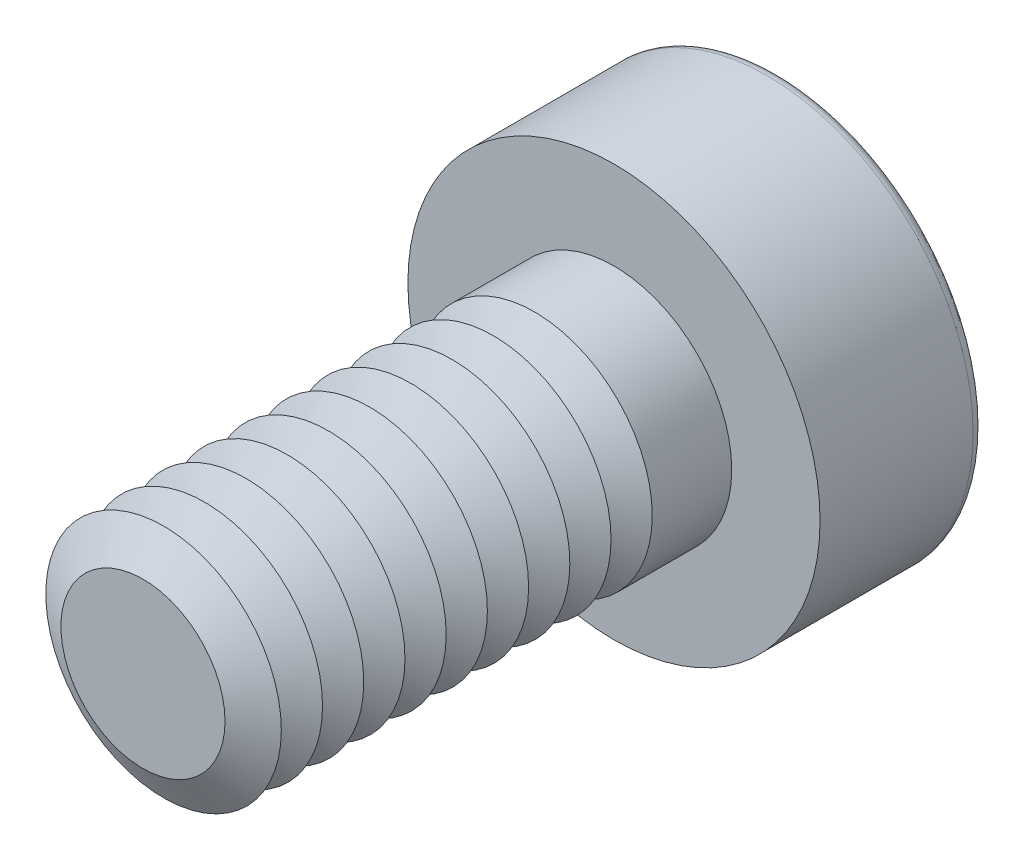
ISO-10303-21;
HEADER;
FILE_DESCRIPTION(('STEP AP214'),'2;1');
FILE_NAME('part.step','',(''),(''),'','','');
FILE_SCHEMA(('AUTOMOTIVE_DESIGN { 1 0 10303 214 1 1 1 1 }'));
ENDSEC;
DATA;
#1=APPLICATION_CONTEXT('core data for automotive mechanical design processes');
#2=APPLICATION_PROTOCOL_DEFINITION('international standard','automotive_design',2000,#1);
#3=PRODUCT_CONTEXT('',#1,'mechanical');
#4=PRODUCT('Part','Part','',(#3));
#5=PRODUCT_RELATED_PRODUCT_CATEGORY('part','',(#4));
#6=PRODUCT_DEFINITION_FORMATION('','',#4);
#7=PRODUCT_DEFINITION_CONTEXT('part definition',#1,'design');
#8=PRODUCT_DEFINITION('design','',#6,#7);
#9=PRODUCT_DEFINITION_SHAPE('','',#8);
#10=(LENGTH_UNIT() NAMED_UNIT(*) SI_UNIT(.MILLI.,.METRE.));
#11=(NAMED_UNIT(*) PLANE_ANGLE_UNIT() SI_UNIT($,.RADIAN.));
#12=(NAMED_UNIT(*) SI_UNIT($,.STERADIAN.) SOLID_ANGLE_UNIT());
#13=UNCERTAINTY_MEASURE_WITH_UNIT(LENGTH_MEASURE(1.E-05),#10,'distance_accuracy_value','');
#14=(GEOMETRIC_REPRESENTATION_CONTEXT(3) GLOBAL_UNCERTAINTY_ASSIGNED_CONTEXT((#13)) GLOBAL_UNIT_ASSIGNED_CONTEXT((#10,
#11,#12)) REPRESENTATION_CONTEXT('',''));
#15=CARTESIAN_POINT('',(0.,0.,0.));
#16=DIRECTION('',(0.,0.,1.));
#17=DIRECTION('',(1.,0.,0.));
#18=AXIS2_PLACEMENT_3D('',#15,#16,#17);
#19=CARTESIAN_POINT('',(0.,0.,5.55));
#20=DIRECTION('',(0.,0.,1.));
#21=DIRECTION('',(1.,0.,0.));
#22=AXIS2_PLACEMENT_3D('',#19,#20,#21);
#23=CONICAL_SURFACE('',#22,2.,1.0471975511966);
#24=CARTESIAN_POINT('',(0.,0.,5.2));
#25=DIRECTION('',(0.,0.,1.));
#26=DIRECTION('',(1.,0.,0.));
#27=AXIS2_PLACEMENT_3D('',#24,#25,#26);
#28=CIRCLE('',#27,1.39378221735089);
#29=CARTESIAN_POINT('',(1.39378221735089,0.,5.2));
#30=VERTEX_POINT('',#29);
#31=EDGE_CURVE('E312',#30,#30,#28,.T.);
#32=ORIENTED_EDGE('',*,*,#31,.T.);
#33=EDGE_LOOP('',(#32));
#34=FACE_BOUND('',#33,.T.);
#35=CARTESIAN_POINT('',(0.,0.,5.55));
#36=DIRECTION('',(0.,0.,1.));
#37=DIRECTION('',(1.,0.,0.));
#38=AXIS2_PLACEMENT_3D('',#35,#36,#37);
#39=CIRCLE('',#38,2.);
#40=CARTESIAN_POINT('',(2.,0.,5.55));
#41=VERTEX_POINT('',#40);
#42=EDGE_CURVE('E315',#41,#41,#39,.T.);
#43=ORIENTED_EDGE('',*,*,#42,.F.);
#44=EDGE_LOOP('',(#43));
#45=FACE_BOUND('',#44,.T.);
#46=ADVANCED_FACE('F39',(#34,#45),#23,.T.);
#47=CARTESIAN_POINT('',(0.,0.,5.2));
#48=DIRECTION('',(0.,0.,-1.));
#49=DIRECTION('',(-1.,0.,0.));
#50=AXIS2_PLACEMENT_3D('',#47,#48,#49);
#51=CONICAL_SURFACE('',#50,1.39378221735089,1.0471975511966);
#52=CARTESIAN_POINT('',(0.,0.,4.85));
#53=DIRECTION('',(0.,0.,1.));
#54=DIRECTION('',(1.,0.,0.));
#55=AXIS2_PLACEMENT_3D('',#52,#53,#54);
#56=CIRCLE('',#55,2.);
#57=CARTESIAN_POINT('',(2.,0.,4.85));
#58=VERTEX_POINT('',#57);
#59=EDGE_CURVE('E323',#58,#58,#56,.T.);
#60=ORIENTED_EDGE('',*,*,#59,.T.);
#61=EDGE_LOOP('',(#60));
#62=FACE_BOUND('',#61,.T.);
#63=ORIENTED_EDGE('',*,*,#31,.F.);
#64=EDGE_LOOP('',(#63));
#65=FACE_BOUND('',#64,.T.);
#66=ADVANCED_FACE('F244',(#62,#65),#51,.T.);
#67=CARTESIAN_POINT('',(0.,0.,8.));
#68=DIRECTION('',(0.,0.,1.));
#69=DIRECTION('',(1.,0.,0.));
#70=AXIS2_PLACEMENT_3D('',#67,#68,#69);
#71=PLANE('',#70);
#72=CARTESIAN_POINT('',(0.,0.,8.));
#73=DIRECTION('',(0.,0.,1.));
#74=DIRECTION('',(1.,0.,0.));
#75=AXIS2_PLACEMENT_3D('',#72,#73,#74);
#76=CIRCLE('',#75,1.39378221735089);
#77=CARTESIAN_POINT('',(1.39378221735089,0.,8.));
#78=VERTEX_POINT('',#77);
#79=EDGE_CURVE('E173',#78,#78,#76,.T.);
#80=ORIENTED_EDGE('',*,*,#79,.T.);
#81=EDGE_LOOP('',(#80));
#82=FACE_BOUND('',#81,.T.);
#83=ADVANCED_FACE('F250',(#82),#71,.T.);
#84=CARTESIAN_POINT('',(0.,0.,8.));
#85=DIRECTION('',(0.,0.,-1.));
#86=DIRECTION('',(-1.,0.,0.));
#87=AXIS2_PLACEMENT_3D('',#84,#85,#86);
#88=CONICAL_SURFACE('',#87,1.39378221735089,1.0471975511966);
#89=CARTESIAN_POINT('',(0.,0.,7.65));
#90=DIRECTION('',(0.,0.,1.));
#91=DIRECTION('',(1.,0.,0.));
#92=AXIS2_PLACEMENT_3D('',#89,#90,#91);
#93=CIRCLE('',#92,2.);
#94=CARTESIAN_POINT('',(2.,0.,7.65));
#95=VERTEX_POINT('',#94);
#96=EDGE_CURVE('E290',#95,#95,#93,.T.);
#97=ORIENTED_EDGE('',*,*,#96,.T.);
#98=EDGE_LOOP('',(#97));
#99=FACE_BOUND('',#98,.T.);
#100=ORIENTED_EDGE('',*,*,#79,.F.);
#101=EDGE_LOOP('',(#100));
#102=FACE_BOUND('',#101,.T.);
#103=ADVANCED_FACE('F198',(#99,#102),#88,.T.);
#104=CARTESIAN_POINT('',(0.,0.,7.65));
#105=DIRECTION('',(0.,0.,1.));
#106=DIRECTION('',(1.,0.,0.));
#107=AXIS2_PLACEMENT_3D('',#104,#105,#106);
#108=CONICAL_SURFACE('',#107,2.,1.0471975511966);
#109=CARTESIAN_POINT('',(0.,0.,7.3));
#110=DIRECTION('',(0.,0.,1.));
#111=DIRECTION('',(1.,0.,0.));
#112=AXIS2_PLACEMENT_3D('',#109,#110,#111);
#113=CIRCLE('',#112,1.39378221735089);
#114=CARTESIAN_POINT('',(1.39378221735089,0.,7.3));
#115=VERTEX_POINT('',#114);
#116=EDGE_CURVE('E287',#115,#115,#113,.T.);
#117=ORIENTED_EDGE('',*,*,#116,.T.);
#118=EDGE_LOOP('',(#117));
#119=FACE_BOUND('',#118,.T.);
#120=ORIENTED_EDGE('',*,*,#96,.F.);
#121=EDGE_LOOP('',(#120));
#122=FACE_BOUND('',#121,.T.);
#123=ADVANCED_FACE('F276',(#119,#122),#108,.T.);
#124=CARTESIAN_POINT('',(0.,0.,7.3));
#125=DIRECTION('',(0.,0.,-1.));
#126=DIRECTION('',(-1.,0.,0.));
#127=AXIS2_PLACEMENT_3D('',#124,#125,#126);
#128=CONICAL_SURFACE('',#127,1.39378221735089,1.0471975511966);
#129=CARTESIAN_POINT('',(0.,0.,6.95));
#130=DIRECTION('',(0.,0.,1.));
#131=DIRECTION('',(1.,0.,0.));
#132=AXIS2_PLACEMENT_3D('',#129,#130,#131);
#133=CIRCLE('',#132,2.);
#134=CARTESIAN_POINT('',(2.,0.,6.95));
#135=VERTEX_POINT('',#134);
#136=EDGE_CURVE('E298',#135,#135,#133,.T.);
#137=ORIENTED_EDGE('',*,*,#136,.T.);
#138=EDGE_LOOP('',(#137));
#139=FACE_BOUND('',#138,.T.);
#140=ORIENTED_EDGE('',*,*,#116,.F.);
#141=EDGE_LOOP('',(#140));
#142=FACE_BOUND('',#141,.T.);
#143=ADVANCED_FACE('F273',(#139,#142),#128,.T.);
#144=CARTESIAN_POINT('',(0.,0.,6.95));
#145=DIRECTION('',(0.,0.,1.));
#146=DIRECTION('',(1.,0.,0.));
#147=AXIS2_PLACEMENT_3D('',#144,#145,#146);
#148=CONICAL_SURFACE('',#147,2.,1.0471975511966);
#149=CARTESIAN_POINT('',(0.,0.,6.6));
#150=DIRECTION('',(0.,0.,1.));
#151=DIRECTION('',(1.,0.,0.));
#152=AXIS2_PLACEMENT_3D('',#149,#150,#151);
#153=CIRCLE('',#152,1.39378221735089);
#154=CARTESIAN_POINT('',(1.39378221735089,0.,6.6));
#155=VERTEX_POINT('',#154);
#156=EDGE_CURVE('E292',#155,#155,#153,.T.);
#157=ORIENTED_EDGE('',*,*,#156,.T.);
#158=EDGE_LOOP('',(#157));
#159=FACE_BOUND('',#158,.T.);
#160=ORIENTED_EDGE('',*,*,#136,.F.);
#161=EDGE_LOOP('',(#160));
#162=FACE_BOUND('',#161,.T.);
#163=ADVANCED_FACE('F269',(#159,#162),#148,.T.);
#164=CARTESIAN_POINT('',(0.,0.,6.6));
#165=DIRECTION('',(0.,0.,-1.));
#166=DIRECTION('',(-1.,0.,0.));
#167=AXIS2_PLACEMENT_3D('',#164,#165,#166);
#168=CONICAL_SURFACE('',#167,1.39378221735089,1.0471975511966);
#169=CARTESIAN_POINT('',(0.,0.,6.25));
#170=DIRECTION('',(0.,0.,1.));
#171=DIRECTION('',(1.,0.,0.));
#172=AXIS2_PLACEMENT_3D('',#169,#170,#171);
#173=CIRCLE('',#172,2.);
#174=CARTESIAN_POINT('',(2.,0.,6.25));
#175=VERTEX_POINT('',#174);
#176=EDGE_CURVE('E308',#175,#175,#173,.T.);
#177=ORIENTED_EDGE('',*,*,#176,.T.);
#178=EDGE_LOOP('',(#177));
#179=FACE_BOUND('',#178,.T.);
#180=ORIENTED_EDGE('',*,*,#156,.F.);
#181=EDGE_LOOP('',(#180));
#182=FACE_BOUND('',#181,.T.);
#183=ADVANCED_FACE('F265',(#179,#182),#168,.T.);
#184=CARTESIAN_POINT('',(0.,0.,6.25));
#185=DIRECTION('',(0.,0.,1.));
#186=DIRECTION('',(1.,0.,0.));
#187=AXIS2_PLACEMENT_3D('',#184,#185,#186);
#188=CONICAL_SURFACE('',#187,2.,1.0471975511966);
#189=CARTESIAN_POINT('',(0.,0.,5.9));
#190=DIRECTION('',(0.,0.,1.));
#191=DIRECTION('',(1.,0.,0.));
#192=AXIS2_PLACEMENT_3D('',#189,#190,#191);
#193=CIRCLE('',#192,1.39378221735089);
#194=CARTESIAN_POINT('',(1.39378221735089,0.,5.9));
#195=VERTEX_POINT('',#194);
#196=EDGE_CURVE('E304',#195,#195,#193,.T.);
#197=ORIENTED_EDGE('',*,*,#196,.T.);
#198=EDGE_LOOP('',(#197));
#199=FACE_BOUND('',#198,.T.);
#200=ORIENTED_EDGE('',*,*,#176,.F.);
#201=EDGE_LOOP('',(#200));
#202=FACE_BOUND('',#201,.T.);
#203=ADVANCED_FACE('F261',(#199,#202),#188,.T.);
#204=CARTESIAN_POINT('',(0.,0.,5.9));
#205=DIRECTION('',(0.,0.,-1.));
#206=DIRECTION('',(-1.,0.,0.));
#207=AXIS2_PLACEMENT_3D('',#204,#205,#206);
#208=CONICAL_SURFACE('',#207,1.39378221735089,1.0471975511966);
#209=ORIENTED_EDGE('',*,*,#42,.T.);
#210=EDGE_LOOP('',(#209));
#211=FACE_BOUND('',#210,.T.);
#212=ORIENTED_EDGE('',*,*,#196,.F.);
#213=EDGE_LOOP('',(#212));
#214=FACE_BOUND('',#213,.T.);
#215=ADVANCED_FACE('F257',(#211,#214),#208,.T.);
#216=CARTESIAN_POINT('',(0.,0.,4.85));
#217=DIRECTION('',(0.,0.,1.));
#218=DIRECTION('',(1.,0.,0.));
#219=AXIS2_PLACEMENT_3D('',#216,#217,#218);
#220=CONICAL_SURFACE('',#219,2.,1.0471975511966);
#221=CARTESIAN_POINT('',(0.,0.,4.5));
#222=DIRECTION('',(0.,0.,1.));
#223=DIRECTION('',(1.,0.,0.));
#224=AXIS2_PLACEMENT_3D('',#221,#222,#223);
#225=CIRCLE('',#224,1.39378221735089);
#226=CARTESIAN_POINT('',(1.39378221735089,0.,4.5));
#227=VERTEX_POINT('',#226);
#228=EDGE_CURVE('E319',#227,#227,#225,.T.);
#229=ORIENTED_EDGE('',*,*,#228,.T.);
#230=EDGE_LOOP('',(#229));
#231=FACE_BOUND('',#230,.T.);
#232=ORIENTED_EDGE('',*,*,#59,.F.);
#233=EDGE_LOOP('',(#232));
#234=FACE_BOUND('',#233,.T.);
#235=ADVANCED_FACE('F260',(#231,#234),#220,.T.);
#236=CARTESIAN_POINT('',(0.,0.,4.5));
#237=DIRECTION('',(0.,0.,-1.));
#238=DIRECTION('',(-1.,0.,0.));
#239=AXIS2_PLACEMENT_3D('',#236,#237,#238);
#240=CONICAL_SURFACE('',#239,1.39378221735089,1.0471975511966);
#241=CARTESIAN_POINT('',(0.,0.,4.15));
#242=DIRECTION('',(0.,0.,1.));
#243=DIRECTION('',(1.,0.,0.));
#244=AXIS2_PLACEMENT_3D('',#241,#242,#243);
#245=CIRCLE('',#244,2.);
#246=CARTESIAN_POINT('',(2.,0.,4.15));
#247=VERTEX_POINT('',#246);
#248=EDGE_CURVE('E331',#247,#247,#245,.T.);
#249=ORIENTED_EDGE('',*,*,#248,.T.);
#250=EDGE_LOOP('',(#249));
#251=FACE_BOUND('',#250,.T.);
#252=ORIENTED_EDGE('',*,*,#228,.F.);
#253=EDGE_LOOP('',(#252));
#254=FACE_BOUND('',#253,.T.);
#255=ADVANCED_FACE('F399',(#251,#254),#240,.T.);
#256=CARTESIAN_POINT('',(0.,0.,4.15));
#257=DIRECTION('',(0.,0.,1.));
#258=DIRECTION('',(1.,0.,0.));
#259=AXIS2_PLACEMENT_3D('',#256,#257,#258);
#260=CONICAL_SURFACE('',#259,2.,1.0471975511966);
#261=CARTESIAN_POINT('',(0.,0.,3.8));
#262=DIRECTION('',(0.,0.,1.));
#263=DIRECTION('',(1.,0.,0.));
#264=AXIS2_PLACEMENT_3D('',#261,#262,#263);
#265=CIRCLE('',#264,1.39378221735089);
#266=CARTESIAN_POINT('',(1.39378221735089,0.,3.8));
#267=VERTEX_POINT('',#266);
#268=EDGE_CURVE('E327',#267,#267,#265,.T.);
#269=ORIENTED_EDGE('',*,*,#268,.T.);
#270=EDGE_LOOP('',(#269));
#271=FACE_BOUND('',#270,.T.);
#272=ORIENTED_EDGE('',*,*,#248,.F.);
#273=EDGE_LOOP('',(#272));
#274=FACE_BOUND('',#273,.T.);
#275=ADVANCED_FACE('F395',(#271,#274),#260,.T.);
#276=CARTESIAN_POINT('',(0.,0.,3.8));
#277=DIRECTION('',(0.,0.,-1.));
#278=DIRECTION('',(-1.,0.,0.));
#279=AXIS2_PLACEMENT_3D('',#276,#277,#278);
#280=CONICAL_SURFACE('',#279,1.39378221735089,1.0471975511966);
#281=CARTESIAN_POINT('',(0.,0.,3.45));
#282=DIRECTION('',(0.,0.,1.));
#283=DIRECTION('',(1.,0.,0.));
#284=AXIS2_PLACEMENT_3D('',#281,#282,#283);
#285=CIRCLE('',#284,2.);
#286=CARTESIAN_POINT('',(2.,0.,3.45));
#287=VERTEX_POINT('',#286);
#288=EDGE_CURVE('E338',#287,#287,#285,.T.);
#289=ORIENTED_EDGE('',*,*,#288,.T.);
#290=EDGE_LOOP('',(#289));
#291=FACE_BOUND('',#290,.T.);
#292=ORIENTED_EDGE('',*,*,#268,.F.);
#293=EDGE_LOOP('',(#292));
#294=FACE_BOUND('',#293,.T.);
#295=ADVANCED_FACE('F391',(#291,#294),#280,.T.);
#296=CARTESIAN_POINT('',(0.,0.,3.45));
#297=DIRECTION('',(0.,0.,1.));
#298=DIRECTION('',(1.,0.,0.));
#299=AXIS2_PLACEMENT_3D('',#296,#297,#298);
#300=CONICAL_SURFACE('',#299,2.,1.0471975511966);
#301=CARTESIAN_POINT('',(0.,0.,3.1));
#302=DIRECTION('',(0.,0.,1.));
#303=DIRECTION('',(1.,0.,0.));
#304=AXIS2_PLACEMENT_3D('',#301,#302,#303);
#305=CIRCLE('',#304,1.39378221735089);
#306=CARTESIAN_POINT('',(1.39378221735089,0.,3.1));
#307=VERTEX_POINT('',#306);
#308=EDGE_CURVE('E334',#307,#307,#305,.T.);
#309=ORIENTED_EDGE('',*,*,#308,.T.);
#310=EDGE_LOOP('',(#309));
#311=FACE_BOUND('',#310,.T.);
#312=ORIENTED_EDGE('',*,*,#288,.F.);
#313=EDGE_LOOP('',(#312));
#314=FACE_BOUND('',#313,.T.);
#315=ADVANCED_FACE('F387',(#311,#314),#300,.T.);
#316=CARTESIAN_POINT('',(0.,0.,3.1));
#317=DIRECTION('',(0.,0.,-1.));
#318=DIRECTION('',(-1.,0.,0.));
#319=AXIS2_PLACEMENT_3D('',#316,#317,#318);
#320=CONICAL_SURFACE('',#319,1.39378221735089,1.0471975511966);
#321=CARTESIAN_POINT('',(0.,0.,2.75));
#322=DIRECTION('',(0.,0.,1.));
#323=DIRECTION('',(1.,0.,0.));
#324=AXIS2_PLACEMENT_3D('',#321,#322,#323);
#325=CIRCLE('',#324,2.);
#326=CARTESIAN_POINT('',(2.,0.,2.75));
#327=VERTEX_POINT('',#326);
#328=EDGE_CURVE('E346',#327,#327,#325,.T.);
#329=ORIENTED_EDGE('',*,*,#328,.T.);
#330=EDGE_LOOP('',(#329));
#331=FACE_BOUND('',#330,.T.);
#332=ORIENTED_EDGE('',*,*,#308,.F.);
#333=EDGE_LOOP('',(#332));
#334=FACE_BOUND('',#333,.T.);
#335=ADVANCED_FACE('F383',(#331,#334),#320,.T.);
#336=CARTESIAN_POINT('',(0.,0.,2.75));
#337=DIRECTION('',(0.,0.,1.));
#338=DIRECTION('',(1.,0.,0.));
#339=AXIS2_PLACEMENT_3D('',#336,#337,#338);
#340=CONICAL_SURFACE('',#339,2.,1.0471975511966);
#341=CARTESIAN_POINT('',(0.,0.,2.4));
#342=DIRECTION('',(0.,0.,1.));
#343=DIRECTION('',(1.,0.,0.));
#344=AXIS2_PLACEMENT_3D('',#341,#342,#343);
#345=CIRCLE('',#344,1.39378221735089);
#346=CARTESIAN_POINT('',(1.39378221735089,0.,2.4));
#347=VERTEX_POINT('',#346);
#348=EDGE_CURVE('E342',#347,#347,#345,.T.);
#349=ORIENTED_EDGE('',*,*,#348,.T.);
#350=EDGE_LOOP('',(#349));
#351=FACE_BOUND('',#350,.T.);
#352=ORIENTED_EDGE('',*,*,#328,.F.);
#353=EDGE_LOOP('',(#352));
#354=FACE_BOUND('',#353,.T.);
#355=ADVANCED_FACE('F378',(#351,#354),#340,.T.);
#356=CARTESIAN_POINT('',(0.,0.,2.4));
#357=DIRECTION('',(0.,0.,-1.));
#358=DIRECTION('',(-1.,0.,0.));
#359=AXIS2_PLACEMENT_3D('',#356,#357,#358);
#360=CONICAL_SURFACE('',#359,1.39378221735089,1.0471975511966);
#361=CARTESIAN_POINT('',(0.,0.,2.05));
#362=DIRECTION('',(0.,0.,1.));
#363=DIRECTION('',(1.,0.,0.));
#364=AXIS2_PLACEMENT_3D('',#361,#362,#363);
#365=CIRCLE('',#364,2.);
#366=CARTESIAN_POINT('',(2.,0.,2.05));
#367=VERTEX_POINT('',#366);
#368=EDGE_CURVE('E358',#367,#367,#365,.T.);
#369=ORIENTED_EDGE('',*,*,#368,.T.);
#370=EDGE_LOOP('',(#369));
#371=FACE_BOUND('',#370,.T.);
#372=ORIENTED_EDGE('',*,*,#348,.F.);
#373=EDGE_LOOP('',(#372));
#374=FACE_BOUND('',#373,.T.);
#375=ADVANCED_FACE('F364',(#371,#374),#360,.T.);
#376=CARTESIAN_POINT('',(0.,0.,2.05));
#377=DIRECTION('',(0.,0.,1.));
#378=DIRECTION('',(1.,0.,0.));
#379=AXIS2_PLACEMENT_3D('',#376,#377,#378);
#380=CONICAL_SURFACE('',#379,2.,1.0471975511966);
#381=CARTESIAN_POINT('',(0.,0.,1.7));
#382=DIRECTION('',(0.,0.,1.));
#383=DIRECTION('',(1.,0.,0.));
#384=AXIS2_PLACEMENT_3D('',#381,#382,#383);
#385=CIRCLE('',#384,1.39378221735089);
#386=CARTESIAN_POINT('',(1.39378221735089,0.,1.7));
#387=VERTEX_POINT('',#386);
#388=EDGE_CURVE('E350',#387,#387,#385,.T.);
#389=ORIENTED_EDGE('',*,*,#388,.T.);
#390=EDGE_LOOP('',(#389));
#391=FACE_BOUND('',#390,.T.);
#392=ORIENTED_EDGE('',*,*,#368,.F.);
#393=EDGE_LOOP('',(#392));
#394=FACE_BOUND('',#393,.T.);
#395=ADVANCED_FACE('F367',(#391,#394),#380,.T.);
#396=CARTESIAN_POINT('',(0.,0.,1.7));
#397=DIRECTION('',(0.,0.,-1.));
#398=DIRECTION('',(-1.,0.,0.));
#399=AXIS2_PLACEMENT_3D('',#396,#397,#398);
#400=CONICAL_SURFACE('',#399,1.39378221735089,1.0471975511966);
#401=CARTESIAN_POINT('',(0.,0.,1.35));
#402=DIRECTION('',(0.,0.,1.));
#403=DIRECTION('',(1.,0.,0.));
#404=AXIS2_PLACEMENT_3D('',#401,#402,#403);
#405=CIRCLE('',#404,2.);
#406=CARTESIAN_POINT('',(2.,0.,1.35));
#407=VERTEX_POINT('',#406);
#408=EDGE_CURVE('E354',#407,#407,#405,.T.);
#409=ORIENTED_EDGE('',*,*,#408,.T.);
#410=EDGE_LOOP('',(#409));
#411=FACE_BOUND('',#410,.T.);
#412=ORIENTED_EDGE('',*,*,#388,.F.);
#413=EDGE_LOOP('',(#412));
#414=FACE_BOUND('',#413,.T.);
#415=ADVANCED_FACE('F369',(#411,#414),#400,.T.);
#416=CARTESIAN_POINT('',(0.,0.,-0.925));
#417=DIRECTION('',(0.,0.,-1.));
#418=DIRECTION('',(-1.,0.,0.));
#419=AXIS2_PLACEMENT_3D('',#416,#417,#418);
#420=CONICAL_SURFACE('',#419,1.25,1.0471975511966);
#421=CARTESIAN_POINT('',(0.,0.,-0.203312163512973));
#422=VERTEX_POINT('',#421);
#423=VERTEX_LOOP('',#422);
#424=FACE_BOUND('',#423,.T.);
#425=CARTESIAN_POINT('',(0.,0.,-0.925));
#426=DIRECTION('',(0.,0.,-1.));
#427=DIRECTION('',(-1.,0.,0.));
#428=AXIS2_PLACEMENT_3D('',#425,#426,#427);
#429=CIRCLE('',#428,1.25);
#430=CARTESIAN_POINT('',(-1.08253175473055,0.624999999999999,-0.925));
#431=VERTEX_POINT('',#430);
#432=CARTESIAN_POINT('',(0.,1.25,-0.925));
#433=VERTEX_POINT('',#432);
#434=EDGE_CURVE('E149',#431,#433,#429,.T.);
#435=ORIENTED_EDGE('',*,*,#434,.T.);
#436=CARTESIAN_POINT('',(0.,0.,-0.925));
#437=DIRECTION('',(0.,0.,-1.));
#438=DIRECTION('',(-1.,0.,0.));
#439=AXIS2_PLACEMENT_3D('',#436,#437,#438);
#440=CIRCLE('',#439,1.25);
#441=CARTESIAN_POINT('',(1.08253175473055,0.625,-0.925));
#442=VERTEX_POINT('',#441);
#443=EDGE_CURVE('E54',#433,#442,#440,.T.);
#444=ORIENTED_EDGE('',*,*,#443,.T.);
#445=CARTESIAN_POINT('',(1.08253175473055,-0.624999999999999,-0.925));
#446=VERTEX_POINT('',#445);
#447=EDGE_CURVE('E817',#442,#446,#440,.T.);
#448=ORIENTED_EDGE('',*,*,#447,.T.);
#449=CARTESIAN_POINT('',(0.,-1.25,-0.925));
#450=VERTEX_POINT('',#449);
#451=EDGE_CURVE('E815',#446,#450,#440,.T.);
#452=ORIENTED_EDGE('',*,*,#451,.T.);
#453=CARTESIAN_POINT('',(-1.08253175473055,-0.624999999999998,-0.925));
#454=VERTEX_POINT('',#453);
#455=EDGE_CURVE('E810',#450,#454,#440,.T.);
#456=ORIENTED_EDGE('',*,*,#455,.T.);
#457=EDGE_CURVE('E808',#454,#431,#440,.T.);
#458=ORIENTED_EDGE('',*,*,#457,.T.);
#459=EDGE_LOOP('',(#435,#444,#448,#452,#456,#458));
#460=FACE_BOUND('',#459,.T.);
#461=ADVANCED_FACE('F200',(#424,#460),#420,.F.);
#462=CARTESIAN_POINT('',(0.,0.,-0.925));
#463=DIRECTION('',(0.,0.,-1.));
#464=DIRECTION('',(-1.,0.,0.));
#465=AXIS2_PLACEMENT_3D('',#462,#463,#464);
#466=PLANE('',#465);
#467=ORIENTED_EDGE('',*,*,#443,.F.);
#468=DIRECTION('',(1.,0.,0.));
#469=VECTOR('',#468,1.);
#470=CARTESIAN_POINT('',(-0.721687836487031,1.25,-0.925));
#471=LINE('',#470,#469);
#472=CARTESIAN_POINT('',(0.721687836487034,1.25,-0.925));
#473=VERTEX_POINT('',#472);
#474=EDGE_CURVE('E859',#433,#473,#471,.T.);
#475=ORIENTED_EDGE('',*,*,#474,.T.);
#476=DIRECTION('',(0.5,-0.866025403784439,0.));
#477=VECTOR('',#476,1.);
#478=CARTESIAN_POINT('',(0.721687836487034,1.25,-0.925));
#479=LINE('',#478,#477);
#480=EDGE_CURVE('E155',#473,#442,#479,.T.);
#481=ORIENTED_EDGE('',*,*,#480,.T.);
#482=EDGE_LOOP('',(#467,#475,#481));
#483=FACE_BOUND('',#482,.T.);
#484=ADVANCED_FACE('F452',(#483),#466,.T.);
#485=ORIENTED_EDGE('',*,*,#447,.F.);
#486=CARTESIAN_POINT('',(1.44337567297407,0.,-0.925));
#487=VERTEX_POINT('',#486);
#488=EDGE_CURVE('E854',#442,#487,#479,.T.);
#489=ORIENTED_EDGE('',*,*,#488,.T.);
#490=DIRECTION('',(-0.5,-0.866025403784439,0.));
#491=VECTOR('',#490,1.);
#492=CARTESIAN_POINT('',(1.44337567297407,0.,-0.925));
#493=LINE('',#492,#491);
#494=EDGE_CURVE('E829',#487,#446,#493,.T.);
#495=ORIENTED_EDGE('',*,*,#494,.T.);
#496=EDGE_LOOP('',(#485,#489,#495));
#497=FACE_BOUND('',#496,.T.);
#498=ADVANCED_FACE('F462',(#497),#466,.T.);
#499=ORIENTED_EDGE('',*,*,#451,.F.);
#500=CARTESIAN_POINT('',(0.721687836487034,-1.25,-0.925));
#501=VERTEX_POINT('',#500);
#502=EDGE_CURVE('E831',#446,#501,#493,.T.);
#503=ORIENTED_EDGE('',*,*,#502,.T.);
#504=DIRECTION('',(-1.,0.,0.));
#505=VECTOR('',#504,1.);
#506=CARTESIAN_POINT('',(0.721687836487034,-1.25,-0.925));
#507=LINE('',#506,#505);
#508=EDGE_CURVE('E782',#501,#450,#507,.T.);
#509=ORIENTED_EDGE('',*,*,#508,.T.);
#510=EDGE_LOOP('',(#499,#503,#509));
#511=FACE_BOUND('',#510,.T.);
#512=ADVANCED_FACE('F472',(#511),#466,.T.);
#513=ORIENTED_EDGE('',*,*,#455,.F.);
#514=CARTESIAN_POINT('',(-0.721687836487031,-1.25,-0.925));
#515=VERTEX_POINT('',#514);
#516=EDGE_CURVE('E825',#450,#515,#507,.T.);
#517=ORIENTED_EDGE('',*,*,#516,.T.);
#518=DIRECTION('',(-0.499999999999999,0.866025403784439,0.));
#519=VECTOR('',#518,1.);
#520=CARTESIAN_POINT('',(-0.721687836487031,-1.25,-0.925));
#521=LINE('',#520,#519);
#522=EDGE_CURVE('E827',#515,#454,#521,.T.);
#523=ORIENTED_EDGE('',*,*,#522,.T.);
#524=EDGE_LOOP('',(#513,#517,#523));
#525=FACE_BOUND('',#524,.T.);
#526=ADVANCED_FACE('F480',(#525),#466,.T.);
#527=ORIENTED_EDGE('',*,*,#457,.F.);
#528=CARTESIAN_POINT('',(-1.44337567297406,0.,-0.925));
#529=VERTEX_POINT('',#528);
#530=EDGE_CURVE('E833',#454,#529,#521,.T.);
#531=ORIENTED_EDGE('',*,*,#530,.T.);
#532=DIRECTION('',(0.499999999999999,0.866025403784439,0.));
#533=VECTOR('',#532,1.);
#534=CARTESIAN_POINT('',(-1.44337567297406,0.,-0.925));
#535=LINE('',#534,#533);
#536=EDGE_CURVE('E158',#529,#431,#535,.T.);
#537=ORIENTED_EDGE('',*,*,#536,.T.);
#538=EDGE_LOOP('',(#527,#531,#537));
#539=FACE_BOUND('',#538,.T.);
#540=ADVANCED_FACE('F230',(#539),#466,.T.);
#541=ORIENTED_EDGE('',*,*,#434,.F.);
#542=CARTESIAN_POINT('',(-0.721687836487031,1.25,-0.925));
#543=VERTEX_POINT('',#542);
#544=EDGE_CURVE('E840',#431,#543,#535,.T.);
#545=ORIENTED_EDGE('',*,*,#544,.T.);
#546=EDGE_CURVE('E855',#543,#433,#471,.T.);
#547=ORIENTED_EDGE('',*,*,#546,.T.);
#548=EDGE_LOOP('',(#541,#545,#547));
#549=FACE_BOUND('',#548,.T.);
#550=ADVANCED_FACE('F464',(#549),#466,.T.);
#551=CARTESIAN_POINT('',(-0.721687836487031,1.25,-0.925));
#552=DIRECTION('',(0.,1.,0.));
#553=DIRECTION('',(0.,0.,1.));
#554=AXIS2_PLACEMENT_3D('',#551,#552,#553);
#555=PLANE('',#554);
#556=DIRECTION('',(0.,0.,-1.));
#557=VECTOR('',#556,1.);
#558=CARTESIAN_POINT('',(-0.721687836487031,1.25,-0.925));
#559=LINE('',#558,#557);
#560=CARTESIAN_POINT('',(-0.721687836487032,1.25,-2.8));
#561=VERTEX_POINT('',#560);
#562=EDGE_CURVE('E147',#543,#561,#559,.T.);
#563=ORIENTED_EDGE('',*,*,#562,.T.);
#564=CARTESIAN_POINT('',(-1.88400474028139,1.25,-3.01907305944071));
#565=CARTESIAN_POINT('',(-1.82756112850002,1.25,-3.00647265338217));
#566=CARTESIAN_POINT('',(-1.77108164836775,1.25,-2.99403280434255));
#567=CARTESIAN_POINT('',(-1.65803301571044,1.25,-2.969555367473));
#568=CARTESIAN_POINT('',(-1.60146385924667,1.25,-2.95751779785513));
#569=CARTESIAN_POINT('',(-1.43148763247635,1.25,-2.92210797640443));
#570=CARTESIAN_POINT('',(-1.31792638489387,1.25,-2.89946453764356));
#571=CARTESIAN_POINT('',(-1.09123200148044,1.25,-2.85732379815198));
#572=CARTESIAN_POINT('',(-0.978103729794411,1.25,-2.83780085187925));
#573=CARTESIAN_POINT('',(-0.75117023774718,1.25,-2.80320860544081));
#574=CARTESIAN_POINT('',(-0.637365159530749,1.25,-2.78813840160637));
#575=CARTESIAN_POINT('',(-0.407744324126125,1.25,-2.76441002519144));
#576=CARTESIAN_POINT('',(-0.291920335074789,1.25,-2.7558257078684));
#577=CARTESIAN_POINT('',(-0.117976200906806,1.25,-2.74931804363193));
#578=CARTESIAN_POINT('',(-0.0599690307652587,1.25,-2.74820997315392));
#579=CARTESIAN_POINT('',(0.0560463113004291,1.25,-2.74816114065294));
#580=CARTESIAN_POINT('',(0.114054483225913,1.25,-2.74922038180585));
#581=CARTESIAN_POINT('',(0.288428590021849,1.25,-2.75560214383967));
#582=CARTESIAN_POINT('',(0.404683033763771,1.25,-2.76414565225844));
#583=CARTESIAN_POINT('',(0.636524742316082,1.25,-2.78800009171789));
#584=CARTESIAN_POINT('',(0.752111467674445,1.25,-2.80331588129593));
#585=CARTESIAN_POINT('',(0.985585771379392,1.25,-2.83897937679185));
#586=CARTESIAN_POINT('',(1.10345418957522,1.25,-2.85944851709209));
#587=CARTESIAN_POINT('',(1.3386179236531,1.25,-2.90348104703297));
#588=CARTESIAN_POINT('',(1.45591314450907,1.25,-2.92704493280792));
#589=CARTESIAN_POINT('',(1.69011362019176,1.25,-2.97617760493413));
#590=CARTESIAN_POINT('',(1.80701875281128,1.25,-3.00174696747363));
#591=CARTESIAN_POINT('',(2.04053091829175,1.25,-3.05421495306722));
#592=CARTESIAN_POINT('',(2.15713794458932,1.25,-3.08111360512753));
#593=CARTESIAN_POINT('',(2.38871499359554,1.25,-3.13548950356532));
#594=CARTESIAN_POINT('',(2.50368762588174,1.25,-3.16295568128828));
#595=CARTESIAN_POINT('',(2.73348169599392,1.25,-3.21852313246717));
#596=CARTESIAN_POINT('',(2.84830313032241,1.25,-3.2466244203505));
#597=CARTESIAN_POINT('',(3.07767157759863,1.25,-3.3032502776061));
#598=CARTESIAN_POINT('',(3.19221874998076,1.25,-3.33177420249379));
#599=CARTESIAN_POINT('',(3.4212203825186,1.25,-3.38917462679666));
#600=CARTESIAN_POINT('',(3.53567484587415,1.25,-3.41805111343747));
#601=CARTESIAN_POINT('',(3.65009781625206,1.25,-3.44705046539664));
#602=B_SPLINE_CURVE_WITH_KNOTS('',3,(#564,#565,#566,#567,#568,#569,#570,#571,#572,#573,#574,
#575,#576,#577,#578,#579,#580,#581,#582,#583,#584,#585,#586,#587,#588,#589,#590,#591,#592,#593,
#594,#595,#596,#597,#598,#599,#600,#601),.UNSPECIFIED.,.F.,.F.,(4,2,2,2,2,2,2,2,2,2,2,2,2,2,2,2,
2,2,4),(0.,0.173498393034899,0.347004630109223,0.694369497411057,1.03871380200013,
1.38298817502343,1.73112607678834,1.90514173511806,2.07915764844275,2.42857002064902,
2.77823347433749,3.13706733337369,3.49595878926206,3.85495373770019,4.21395652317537,
4.56857767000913,4.92320688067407,5.27734186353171,5.63146405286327),.UNSPECIFIED.);
#603=CARTESIAN_POINT('',(0.721687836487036,1.25,-2.8));
#604=VERTEX_POINT('',#603);
#605=EDGE_CURVE('E124',#561,#604,#602,.T.);
#606=ORIENTED_EDGE('',*,*,#605,.T.);
#607=DIRECTION('',(0.,0.,-1.));
#608=VECTOR('',#607,1.);
#609=CARTESIAN_POINT('',(0.721687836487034,1.25,-0.925));
#610=LINE('',#609,#608);
#611=EDGE_CURVE('E143',#473,#604,#610,.T.);
#612=ORIENTED_EDGE('',*,*,#611,.F.);
#613=ORIENTED_EDGE('',*,*,#474,.F.);
#614=ORIENTED_EDGE('',*,*,#546,.F.);
#615=EDGE_LOOP('',(#563,#606,#612,#613,#614));
#616=FACE_BOUND('',#615,.T.);
#617=ADVANCED_FACE('F141',(#616),#555,.F.);
#618=CARTESIAN_POINT('',(0.721687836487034,1.25,-0.925));
#619=DIRECTION('',(0.866025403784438,0.5,0.));
#620=DIRECTION('',(-0.5,0.866025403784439,0.));
#621=AXIS2_PLACEMENT_3D('',#618,#619,#620);
#622=PLANE('',#621);
#623=ORIENTED_EDGE('',*,*,#611,.T.);
#624=CARTESIAN_POINT('',(0.721572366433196,1.2502,-2.80003094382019));
#625=CARTESIAN_POINT('',(0.751551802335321,1.19827409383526,-2.79199301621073));
#626=CARTESIAN_POINT('',(0.781585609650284,1.14625401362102,-2.78469578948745));
#627=CARTESIAN_POINT('',(0.841759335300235,1.04203006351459,-2.7718751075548));
#628=CARTESIAN_POINT('',(0.871899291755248,0.989826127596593,-2.76635237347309));
#629=CARTESIAN_POINT('',(0.932102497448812,0.88555111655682,-2.75740321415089));
#630=CARTESIAN_POINT('',(0.962165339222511,0.83348074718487,-2.75396611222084));
#631=CARTESIAN_POINT('',(1.0223293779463,0.729273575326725,-2.7493572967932));
#632=CARTESIAN_POINT('',(1.05243056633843,0.677136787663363,-2.74818514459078));
#633=CARTESIAN_POINT('',(1.11263294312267,0.572863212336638,-2.74818514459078));
#634=CARTESIAN_POINT('',(1.1427341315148,0.520726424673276,-2.7493572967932));
#635=CARTESIAN_POINT('',(1.20289817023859,0.416519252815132,-2.75396611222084));
#636=CARTESIAN_POINT('',(1.23296101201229,0.364448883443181,-2.75740321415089));
#637=CARTESIAN_POINT('',(1.29316421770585,0.260173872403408,-2.76635237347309));
#638=CARTESIAN_POINT('',(1.32330417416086,0.207969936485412,-2.7718751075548));
#639=CARTESIAN_POINT('',(1.38347789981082,0.103745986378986,-2.78469578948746));
#640=CARTESIAN_POINT('',(1.41351170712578,0.0517259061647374,-2.79199301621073));
#641=CARTESIAN_POINT('',(1.4434911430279,-0.00019999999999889,-2.80003094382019));
#642=B_SPLINE_CURVE_WITH_KNOTS('',3,(#624,#625,#626,#627,#628,#629,#630,#631,#632,#633,#634,
#635,#636,#637,#638,#639,#640,#641),.UNSPECIFIED.,.F.,.F.,(4,2,2,2,2,2,2,2,4),(0.,
0.18149525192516,0.363064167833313,0.543695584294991,0.724292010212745,0.904888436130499,
1.08551985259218,1.26708876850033,1.44858402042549),.UNSPECIFIED.);
#643=CARTESIAN_POINT('',(1.44337567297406,0.,-2.8));
#644=VERTEX_POINT('',#643);
#645=EDGE_CURVE('E11',#604,#644,#642,.T.);
#646=ORIENTED_EDGE('',*,*,#645,.T.);
#647=DIRECTION('',(0.,0.,-1.));
#648=VECTOR('',#647,1.);
#649=CARTESIAN_POINT('',(1.44337567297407,0.,-0.925));
#650=LINE('',#649,#648);
#651=EDGE_CURVE('E157',#487,#644,#650,.T.);
#652=ORIENTED_EDGE('',*,*,#651,.F.);
#653=ORIENTED_EDGE('',*,*,#488,.F.);
#654=ORIENTED_EDGE('',*,*,#480,.F.);
#655=EDGE_LOOP('',(#623,#646,#652,#653,#654));
#656=FACE_BOUND('',#655,.T.);
#657=ADVANCED_FACE('F152',(#656),#622,.F.);
#658=CARTESIAN_POINT('',(1.44337567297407,0.,-0.925));
#659=DIRECTION('',(0.866025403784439,-0.5,0.));
#660=DIRECTION('',(0.5,0.866025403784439,0.));
#661=AXIS2_PLACEMENT_3D('',#658,#659,#660);
#662=PLANE('',#661);
#663=ORIENTED_EDGE('',*,*,#651,.T.);
#664=CARTESIAN_POINT('',(1.4434911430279,0.000200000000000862,-2.80003094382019));
#665=CARTESIAN_POINT('',(1.41351170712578,-0.0517259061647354,-2.79199301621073));
#666=CARTESIAN_POINT('',(1.38347789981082,-0.103745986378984,-2.78469578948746));
#667=CARTESIAN_POINT('',(1.32330417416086,-0.20796993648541,-2.7718751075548));
#668=CARTESIAN_POINT('',(1.29316421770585,-0.260173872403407,-2.76635237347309));
#669=CARTESIAN_POINT('',(1.23296101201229,-0.364448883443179,-2.75740321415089));
#670=CARTESIAN_POINT('',(1.20289817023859,-0.41651925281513,-2.75396611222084));
#671=CARTESIAN_POINT('',(1.1427341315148,-0.520726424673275,-2.7493572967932));
#672=CARTESIAN_POINT('',(1.11263294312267,-0.572863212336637,-2.74818514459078));
#673=CARTESIAN_POINT('',(1.05243056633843,-0.677136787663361,-2.74818514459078));
#674=CARTESIAN_POINT('',(1.0223293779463,-0.729273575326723,-2.7493572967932));
#675=CARTESIAN_POINT('',(0.962165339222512,-0.833480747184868,-2.75396611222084));
#676=CARTESIAN_POINT('',(0.932102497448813,-0.885551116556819,-2.75740321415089));
#677=CARTESIAN_POINT('',(0.871899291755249,-0.989826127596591,-2.76635237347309));
#678=CARTESIAN_POINT('',(0.841759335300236,-1.04203006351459,-2.7718751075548));
#679=CARTESIAN_POINT('',(0.781585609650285,-1.14625401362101,-2.78469578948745));
#680=CARTESIAN_POINT('',(0.751551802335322,-1.19827409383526,-2.79199301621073));
#681=CARTESIAN_POINT('',(0.721572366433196,-1.2502,-2.80003094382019));
#682=B_SPLINE_CURVE_WITH_KNOTS('',3,(#664,#665,#666,#667,#668,#669,#670,#671,#672,#673,#674,
#675,#676,#677,#678,#679,#680,#681),.UNSPECIFIED.,.F.,.F.,(4,2,2,2,2,2,2,2,4),(0.,
0.18149525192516,0.363064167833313,0.543695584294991,0.724292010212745,0.904888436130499,
1.08551985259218,1.26708876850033,1.44858402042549),.UNSPECIFIED.);
#683=CARTESIAN_POINT('',(0.721687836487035,-1.25,-2.8));
#684=VERTEX_POINT('',#683);
#685=EDGE_CURVE('E172',#644,#684,#682,.T.);
#686=ORIENTED_EDGE('',*,*,#685,.T.);
#687=DIRECTION('',(0.,0.,-1.));
#688=VECTOR('',#687,1.);
#689=CARTESIAN_POINT('',(0.721687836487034,-1.25,-0.925));
#690=LINE('',#689,#688);
#691=EDGE_CURVE('E777',#501,#684,#690,.T.);
#692=ORIENTED_EDGE('',*,*,#691,.F.);
#693=ORIENTED_EDGE('',*,*,#502,.F.);
#694=ORIENTED_EDGE('',*,*,#494,.F.);
#695=EDGE_LOOP('',(#663,#686,#692,#693,#694));
#696=FACE_BOUND('',#695,.T.);
#697=ADVANCED_FACE('F190',(#696),#662,.F.);
#698=CARTESIAN_POINT('',(0.721687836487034,-1.25,-0.925));
#699=DIRECTION('',(0.,-1.,0.));
#700=DIRECTION('',(1.,0.,0.));
#701=AXIS2_PLACEMENT_3D('',#698,#699,#700);
#702=PLANE('',#701);
#703=ORIENTED_EDGE('',*,*,#691,.T.);
#704=CARTESIAN_POINT('',(-1.88400474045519,-1.25,-3.01907305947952));
#705=CARTESIAN_POINT('',(-1.8275611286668,-1.25,-3.00647265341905));
#706=CARTESIAN_POINT('',(-1.77108164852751,-1.25,-2.99403280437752));
#707=CARTESIAN_POINT('',(-1.65803301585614,-1.25,-2.96955536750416));
#708=CARTESIAN_POINT('',(-1.60146385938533,-1.25,-2.95751779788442));
#709=CARTESIAN_POINT('',(-1.43148763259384,-1.25,-2.92210797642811));
#710=CARTESIAN_POINT('',(-1.3179263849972,-1.25,-2.89946453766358));
#711=CARTESIAN_POINT('',(-1.09123200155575,-1.25,-2.85732379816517));
#712=CARTESIAN_POINT('',(-0.978103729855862,-1.25,-2.83780085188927));
#713=CARTESIAN_POINT('',(-0.751170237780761,-1.25,-2.80320860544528));
#714=CARTESIAN_POINT('',(-0.637365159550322,-1.25,-2.78813840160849));
#715=CARTESIAN_POINT('',(-0.407744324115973,-1.25,-2.76441002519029));
#716=CARTESIAN_POINT('',(-0.29192033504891,-1.25,-2.75582570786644));
#717=CARTESIAN_POINT('',(-0.117976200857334,-1.25,-2.74931804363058));
#718=CARTESIAN_POINT('',(-0.0599690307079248,-1.25,-2.74820997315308));
#719=CARTESIAN_POINT('',(0.0560463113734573,-1.25,-2.74816114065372));
#720=CARTESIAN_POINT('',(0.114054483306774,-1.25,-2.74922038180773));
#721=CARTESIAN_POINT('',(0.288428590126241,-1.25,-2.75560214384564));
#722=CARTESIAN_POINT('',(0.404683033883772,-1.25,-2.76414565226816));
#723=CARTESIAN_POINT('',(0.636524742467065,-1.25,-2.78800009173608));
#724=CARTESIAN_POINT('',(0.752111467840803,-1.25,-2.80331588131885));
#725=CARTESIAN_POINT('',(0.985585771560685,-1.25,-2.8389793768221));
#726=CARTESIAN_POINT('',(1.10345418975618,-1.25,-2.8594485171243));
#727=CARTESIAN_POINT('',(1.33861792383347,-1.25,-2.90348104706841));
#728=CARTESIAN_POINT('',(1.45591314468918,-1.25,-2.92704493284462));
#729=CARTESIAN_POINT('',(1.69011362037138,-1.25,-2.9761776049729));
#730=CARTESIAN_POINT('',(1.80701875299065,-1.25,-3.00174696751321));
#731=CARTESIAN_POINT('',(2.04053091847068,-1.25,-3.05421495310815));
#732=CARTESIAN_POINT('',(2.15713794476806,-1.25,-3.081113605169));
#733=CARTESIAN_POINT('',(2.38871499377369,-1.25,-3.13548950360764));
#734=CARTESIAN_POINT('',(2.50368762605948,-1.25,-3.16295568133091));
#735=CARTESIAN_POINT('',(2.7334816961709,-1.25,-3.21852313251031));
#736=CARTESIAN_POINT('',(2.84830313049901,-1.25,-3.24662442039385));
#737=CARTESIAN_POINT('',(3.07767157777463,-1.25,-3.30325027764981));
#738=CARTESIAN_POINT('',(3.19221875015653,-1.25,-3.33177420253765));
#739=CARTESIAN_POINT('',(3.42122038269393,-1.25,-3.38917462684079));
#740=CARTESIAN_POINT('',(3.53567484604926,-1.25,-3.41805111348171));
#741=CARTESIAN_POINT('',(3.65009781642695,-1.25,-3.44705046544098));
#742=B_SPLINE_CURVE_WITH_KNOTS('',3,(#704,#705,#706,#707,#708,#709,#710,#711,#712,#713,#714,
#715,#716,#717,#718,#719,#720,#721,#722,#723,#724,#725,#726,#727,#728,#729,#730,#731,#732,#733,
#734,#735,#736,#737,#738,#739,#740,#741),.UNSPECIFIED.,.F.,.F.,(4,2,2,2,2,2,2,2,2,2,2,2,2,2,2,2,
2,2,4),(0.,0.173498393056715,0.347004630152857,0.694369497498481,1.03871380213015,
1.382988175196,1.73112607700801,1.90514173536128,2.0791576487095,2.42857002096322,
2.77823347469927,3.13706733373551,3.49595878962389,3.85495373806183,4.2139565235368,
4.56857767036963,4.92320688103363,5.27734186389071,5.63146405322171),.UNSPECIFIED.);
#743=CARTESIAN_POINT('',(-0.721687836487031,-1.25,-2.8));
#744=VERTEX_POINT('',#743);
#745=EDGE_CURVE('E183',#684,#744,#742,.F.);
#746=ORIENTED_EDGE('',*,*,#745,.T.);
#747=DIRECTION('',(0.,0.,-1.));
#748=VECTOR('',#747,1.);
#749=CARTESIAN_POINT('',(-0.721687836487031,-1.25,-0.925));
#750=LINE('',#749,#748);
#751=EDGE_CURVE('E784',#515,#744,#750,.T.);
#752=ORIENTED_EDGE('',*,*,#751,.F.);
#753=ORIENTED_EDGE('',*,*,#516,.F.);
#754=ORIENTED_EDGE('',*,*,#508,.F.);
#755=EDGE_LOOP('',(#703,#746,#752,#753,#754));
#756=FACE_BOUND('',#755,.T.);
#757=ADVANCED_FACE('F233',(#756),#702,.F.);
#758=CARTESIAN_POINT('',(-0.721687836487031,-1.25,-0.925));
#759=DIRECTION('',(-0.866025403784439,-0.499999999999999,0.));
#760=DIRECTION('',(0.5,-0.866025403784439,0.));
#761=AXIS2_PLACEMENT_3D('',#758,#759,#760);
#762=PLANE('',#761);
#763=ORIENTED_EDGE('',*,*,#751,.T.);
#764=CARTESIAN_POINT('',(-0.721572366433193,-1.2502,-2.80003094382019));
#765=CARTESIAN_POINT('',(-0.751551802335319,-1.19827409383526,-2.79199301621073));
#766=CARTESIAN_POINT('',(-0.781585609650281,-1.14625401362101,-2.78469578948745));
#767=CARTESIAN_POINT('',(-0.841759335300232,-1.04203006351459,-2.7718751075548));
#768=CARTESIAN_POINT('',(-0.871899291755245,-0.989826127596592,-2.76635237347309));
#769=CARTESIAN_POINT('',(-0.932102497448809,-0.88555111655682,-2.75740321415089));
#770=CARTESIAN_POINT('',(-0.962165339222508,-0.833480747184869,-2.75396611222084));
#771=CARTESIAN_POINT('',(-1.0223293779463,-0.729273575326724,-2.7493572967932));
#772=CARTESIAN_POINT('',(-1.05243056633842,-0.677136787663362,-2.74818514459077));
#773=CARTESIAN_POINT('',(-1.11263294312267,-0.572863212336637,-2.74818514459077));
#774=CARTESIAN_POINT('',(-1.1427341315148,-0.520726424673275,-2.7493572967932));
#775=CARTESIAN_POINT('',(-1.20289817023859,-0.41651925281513,-2.75396611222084));
#776=CARTESIAN_POINT('',(-1.23296101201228,-0.364448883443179,-2.75740321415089));
#777=CARTESIAN_POINT('',(-1.29316421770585,-0.260173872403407,-2.76635237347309));
#778=CARTESIAN_POINT('',(-1.32330417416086,-0.207969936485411,-2.7718751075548));
#779=CARTESIAN_POINT('',(-1.38347789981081,-0.103745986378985,-2.78469578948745));
#780=CARTESIAN_POINT('',(-1.41351170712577,-0.0517259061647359,-2.79199301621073));
#781=CARTESIAN_POINT('',(-1.4434911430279,0.000200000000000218,-2.80003094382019));
#782=B_SPLINE_CURVE_WITH_KNOTS('',3,(#764,#765,#766,#767,#768,#769,#770,#771,#772,#773,#774,
#775,#776,#777,#778,#779,#780,#781),.UNSPECIFIED.,.F.,.F.,(4,2,2,2,2,2,2,2,4),(0.,
0.18149525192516,0.363064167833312,0.543695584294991,0.724292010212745,0.904888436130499,
1.08551985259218,1.26708876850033,1.44858402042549),.UNSPECIFIED.);
#783=CARTESIAN_POINT('',(-1.44337567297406,0.,-2.8));
#784=VERTEX_POINT('',#783);
#785=EDGE_CURVE('E207',#744,#784,#782,.T.);
#786=ORIENTED_EDGE('',*,*,#785,.T.);
#787=DIRECTION('',(0.,0.,-1.));
#788=VECTOR('',#787,1.);
#789=CARTESIAN_POINT('',(-1.44337567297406,0.,-0.925));
#790=LINE('',#789,#788);
#791=EDGE_CURVE('E788',#529,#784,#790,.T.);
#792=ORIENTED_EDGE('',*,*,#791,.F.);
#793=ORIENTED_EDGE('',*,*,#530,.F.);
#794=ORIENTED_EDGE('',*,*,#522,.F.);
#795=EDGE_LOOP('',(#763,#786,#792,#793,#794));
#796=FACE_BOUND('',#795,.T.);
#797=ADVANCED_FACE('F228',(#796),#762,.F.);
#798=CARTESIAN_POINT('',(-1.44337567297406,0.,-0.925));
#799=DIRECTION('',(-0.866025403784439,0.499999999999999,0.));
#800=DIRECTION('',(-0.5,-0.866025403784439,0.));
#801=AXIS2_PLACEMENT_3D('',#798,#799,#800);
#802=PLANE('',#801);
#803=ORIENTED_EDGE('',*,*,#791,.T.);
#804=CARTESIAN_POINT('',(-1.4434911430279,-0.000199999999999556,-2.80003094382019));
#805=CARTESIAN_POINT('',(-1.41351170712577,0.0517259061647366,-2.79199301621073));
#806=CARTESIAN_POINT('',(-1.38347789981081,0.103745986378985,-2.78469578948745));
#807=CARTESIAN_POINT('',(-1.32330417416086,0.207969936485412,-2.7718751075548));
#808=CARTESIAN_POINT('',(-1.29316421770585,0.260173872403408,-2.76635237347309));
#809=CARTESIAN_POINT('',(-1.23296101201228,0.36444888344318,-2.75740321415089));
#810=CARTESIAN_POINT('',(-1.20289817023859,0.416519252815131,-2.75396611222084));
#811=CARTESIAN_POINT('',(-1.1427341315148,0.520726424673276,-2.7493572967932));
#812=CARTESIAN_POINT('',(-1.11263294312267,0.572863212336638,-2.74818514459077));
#813=CARTESIAN_POINT('',(-1.05243056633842,0.677136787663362,-2.74818514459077));
#814=CARTESIAN_POINT('',(-1.0223293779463,0.729273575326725,-2.7493572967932));
#815=CARTESIAN_POINT('',(-0.962165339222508,0.833480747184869,-2.75396611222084));
#816=CARTESIAN_POINT('',(-0.932102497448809,0.88555111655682,-2.75740321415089));
#817=CARTESIAN_POINT('',(-0.871899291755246,0.989826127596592,-2.76635237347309));
#818=CARTESIAN_POINT('',(-0.841759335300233,1.04203006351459,-2.7718751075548));
#819=CARTESIAN_POINT('',(-0.781585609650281,1.14625401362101,-2.78469578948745));
#820=CARTESIAN_POINT('',(-0.751551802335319,1.19827409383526,-2.79199301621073));
#821=CARTESIAN_POINT('',(-0.721572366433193,1.2502,-2.80003094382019));
#822=B_SPLINE_CURVE_WITH_KNOTS('',3,(#804,#805,#806,#807,#808,#809,#810,#811,#812,#813,#814,
#815,#816,#817,#818,#819,#820,#821),.UNSPECIFIED.,.F.,.F.,(4,2,2,2,2,2,2,2,4),(0.,
0.18149525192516,0.363064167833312,0.543695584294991,0.724292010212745,0.904888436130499,
1.08551985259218,1.26708876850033,1.44858402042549),.UNSPECIFIED.);
#823=EDGE_CURVE('E150',#784,#561,#822,.T.);
#824=ORIENTED_EDGE('',*,*,#823,.T.);
#825=ORIENTED_EDGE('',*,*,#562,.F.);
#826=ORIENTED_EDGE('',*,*,#544,.F.);
#827=ORIENTED_EDGE('',*,*,#536,.F.);
#828=EDGE_LOOP('',(#803,#824,#825,#826,#827));
#829=FACE_BOUND('',#828,.T.);
#830=ADVANCED_FACE('F196',(#829),#802,.F.);
#831=CARTESIAN_POINT('',(0.,0.,-2.8));
#832=DIRECTION('',(0.,0.,-1.));
#833=DIRECTION('',(-1.,0.,0.));
#834=AXIS2_PLACEMENT_3D('',#831,#832,#833);
#835=CONICAL_SURFACE('',#834,1.44337567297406,1.30899693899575);
#836=CARTESIAN_POINT('',(0.,0.,-2.8));
#837=DIRECTION('',(0.,0.,-1.));
#838=DIRECTION('',(-1.,0.,0.));
#839=AXIS2_PLACEMENT_3D('',#836,#837,#838);
#840=CIRCLE('',#839,1.44337567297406);
#841=EDGE_CURVE('E120',#561,#604,#840,.T.);
#842=ORIENTED_EDGE('',*,*,#841,.T.);
#843=ORIENTED_EDGE('',*,*,#605,.F.);
#844=EDGE_LOOP('',(#842,#843));
#845=FACE_BOUND('',#844,.T.);
#846=ADVANCED_FACE('F122',(#845),#835,.F.);
#847=EDGE_CURVE('E129',#604,#644,#840,.T.);
#848=ORIENTED_EDGE('',*,*,#847,.T.);
#849=ORIENTED_EDGE('',*,*,#645,.F.);
#850=EDGE_LOOP('',(#848,#849));
#851=FACE_BOUND('',#850,.T.);
#852=ADVANCED_FACE('F133',(#851),#835,.F.);
#853=EDGE_CURVE('E164',#644,#684,#840,.T.);
#854=ORIENTED_EDGE('',*,*,#853,.T.);
#855=ORIENTED_EDGE('',*,*,#685,.F.);
#856=EDGE_LOOP('',(#854,#855));
#857=FACE_BOUND('',#856,.T.);
#858=ADVANCED_FACE('F545',(#857),#835,.F.);
#859=EDGE_CURVE('E168',#684,#744,#840,.T.);
#860=ORIENTED_EDGE('',*,*,#859,.T.);
#861=ORIENTED_EDGE('',*,*,#745,.F.);
#862=EDGE_LOOP('',(#860,#861));
#863=FACE_BOUND('',#862,.T.);
#864=ADVANCED_FACE('F552',(#863),#835,.F.);
#865=EDGE_CURVE('E67',#744,#784,#840,.T.);
#866=ORIENTED_EDGE('',*,*,#865,.T.);
#867=ORIENTED_EDGE('',*,*,#785,.F.);
#868=EDGE_LOOP('',(#866,#867));
#869=FACE_BOUND('',#868,.T.);
#870=ADVANCED_FACE('F560',(#869),#835,.F.);
#871=EDGE_CURVE('E60',#784,#561,#840,.T.);
#872=ORIENTED_EDGE('',*,*,#871,.T.);
#873=ORIENTED_EDGE('',*,*,#823,.F.);
#874=EDGE_LOOP('',(#872,#873));
#875=FACE_BOUND('',#874,.T.);
#876=ADVANCED_FACE('F197',(#875),#835,.F.);
#877=CARTESIAN_POINT('',(0.,0.,-2.8));
#878=DIRECTION('',(0.,0.,-1.));
#879=DIRECTION('',(-1.,0.,0.));
#880=AXIS2_PLACEMENT_3D('',#877,#878,#879);
#881=PLANE('',#880);
#882=ORIENTED_EDGE('',*,*,#871,.F.);
#883=ORIENTED_EDGE('',*,*,#865,.F.);
#884=ORIENTED_EDGE('',*,*,#859,.F.);
#885=ORIENTED_EDGE('',*,*,#853,.F.);
#886=ORIENTED_EDGE('',*,*,#847,.F.);
#887=ORIENTED_EDGE('',*,*,#841,.F.);
#888=EDGE_LOOP('',(#882,#883,#884,#885,#886,#887));
#889=FACE_BOUND('',#888,.T.);
#890=CARTESIAN_POINT('',(0.,0.,-2.8));
#891=DIRECTION('',(0.,0.,-1.));
#892=DIRECTION('',(-1.,0.,0.));
#893=AXIS2_PLACEMENT_3D('',#890,#891,#892);
#894=CIRCLE('',#893,3.3);
#895=CARTESIAN_POINT('',(-3.3,0.,-2.8));
#896=VERTEX_POINT('',#895);
#897=EDGE_CURVE('E801',#896,#896,#894,.T.);
#898=ORIENTED_EDGE('',*,*,#897,.T.);
#899=EDGE_LOOP('',(#898));
#900=FACE_BOUND('',#899,.T.);
#901=ADVANCED_FACE('F161',(#889,#900),#881,.T.);
#902=CARTESIAN_POINT('',(0.,0.,-2.6));
#903=DIRECTION('',(0.,0.,-1.));
#904=DIRECTION('',(-1.,0.,0.));
#905=AXIS2_PLACEMENT_3D('',#902,#903,#904);
#906=TOROIDAL_SURFACE('',#905,3.3,0.2);
#907=CARTESIAN_POINT('',(0.,0.,-2.6));
#908=DIRECTION('',(0.,0.,-1.));
#909=DIRECTION('',(-1.,0.,0.));
#910=AXIS2_PLACEMENT_3D('',#907,#908,#909);
#911=CIRCLE('',#910,3.5);
#912=CARTESIAN_POINT('',(-3.5,0.,-2.6));
#913=VERTEX_POINT('',#912);
#914=EDGE_CURVE('E805',#913,#913,#911,.F.);
#915=ORIENTED_EDGE('',*,*,#914,.F.);
#916=EDGE_LOOP('',(#915));
#917=FACE_BOUND('',#916,.T.);
#918=ORIENTED_EDGE('',*,*,#897,.F.);
#919=EDGE_LOOP('',(#918));
#920=FACE_BOUND('',#919,.T.);
#921=ADVANCED_FACE('F41',(#917,#920),#906,.T.);
#922=CARTESIAN_POINT('',(0.,0.,-2.8));
#923=DIRECTION('',(0.,0.,1.));
#924=DIRECTION('',(1.,0.,0.));
#925=AXIS2_PLACEMENT_3D('',#922,#923,#924);
#926=CYLINDRICAL_SURFACE('',#925,3.5);
#927=ORIENTED_EDGE('',*,*,#914,.T.);
#928=EDGE_LOOP('',(#927));
#929=FACE_BOUND('',#928,.T.);
#930=CARTESIAN_POINT('',(0.,0.,0.));
#931=DIRECTION('',(0.,0.,-1.));
#932=DIRECTION('',(-1.,0.,0.));
#933=AXIS2_PLACEMENT_3D('',#930,#931,#932);
#934=CIRCLE('',#933,3.5);
#935=CARTESIAN_POINT('',(-3.5,0.,0.));
#936=VERTEX_POINT('',#935);
#937=EDGE_CURVE('E794',#936,#936,#934,.T.);
#938=ORIENTED_EDGE('',*,*,#937,.T.);
#939=EDGE_LOOP('',(#938));
#940=FACE_BOUND('',#939,.T.);
#941=ADVANCED_FACE('F584',(#929,#940),#926,.T.);
#942=CARTESIAN_POINT('',(0.,0.,0.));
#943=DIRECTION('',(0.,0.,-1.));
#944=DIRECTION('',(-1.,0.,0.));
#945=AXIS2_PLACEMENT_3D('',#942,#943,#944);
#946=PLANE('',#945);
#947=CARTESIAN_POINT('',(0.,0.,0.));
#948=DIRECTION('',(0.,0.,1.));
#949=DIRECTION('',(1.,0.,0.));
#950=AXIS2_PLACEMENT_3D('',#947,#948,#949);
#951=CIRCLE('',#950,2.);
#952=CARTESIAN_POINT('',(2.,0.,0.));
#953=VERTEX_POINT('',#952);
#954=EDGE_CURVE('E798',#953,#953,#951,.T.);
#955=ORIENTED_EDGE('',*,*,#954,.F.);
#956=EDGE_LOOP('',(#955));
#957=FACE_BOUND('',#956,.T.);
#958=ORIENTED_EDGE('',*,*,#937,.F.);
#959=EDGE_LOOP('',(#958));
#960=FACE_BOUND('',#959,.T.);
#961=ADVANCED_FACE('F592',(#957,#960),#946,.F.);
#962=CARTESIAN_POINT('',(0.,0.,8.));
#963=DIRECTION('',(0.,0.,-1.));
#964=DIRECTION('',(-1.,0.,0.));
#965=AXIS2_PLACEMENT_3D('',#962,#963,#964);
#966=CYLINDRICAL_SURFACE('',#965,2.);
#967=ORIENTED_EDGE('',*,*,#954,.T.);
#968=EDGE_LOOP('',(#967));
#969=FACE_BOUND('',#968,.T.);
#970=ORIENTED_EDGE('',*,*,#408,.F.);
#971=EDGE_LOOP('',(#970));
#972=FACE_BOUND('',#971,.T.);
#973=ADVANCED_FACE('F601',(#969,#972),#966,.T.);
#974=CLOSED_SHELL('',(#46,#66,#83,#103,#123,#143,#163,#183,#203,#215,#235,#255,#275,#295,#315,
#335,#355,#375,#395,#415,#461,#484,#498,#512,#526,#540,#550,#617,#657,#697,#757,#797,#830,#846,
#852,#858,#864,#870,#876,#901,#921,#941,#961,#973));
#975=MANIFOLD_SOLID_BREP('B2',#974);
#976=ADVANCED_BREP_SHAPE_REPRESENTATION('',(#18,#975),#14);
#977=SHAPE_DEFINITION_REPRESENTATION(#9,#976);
ENDSEC;
END-ISO-10303-21;
